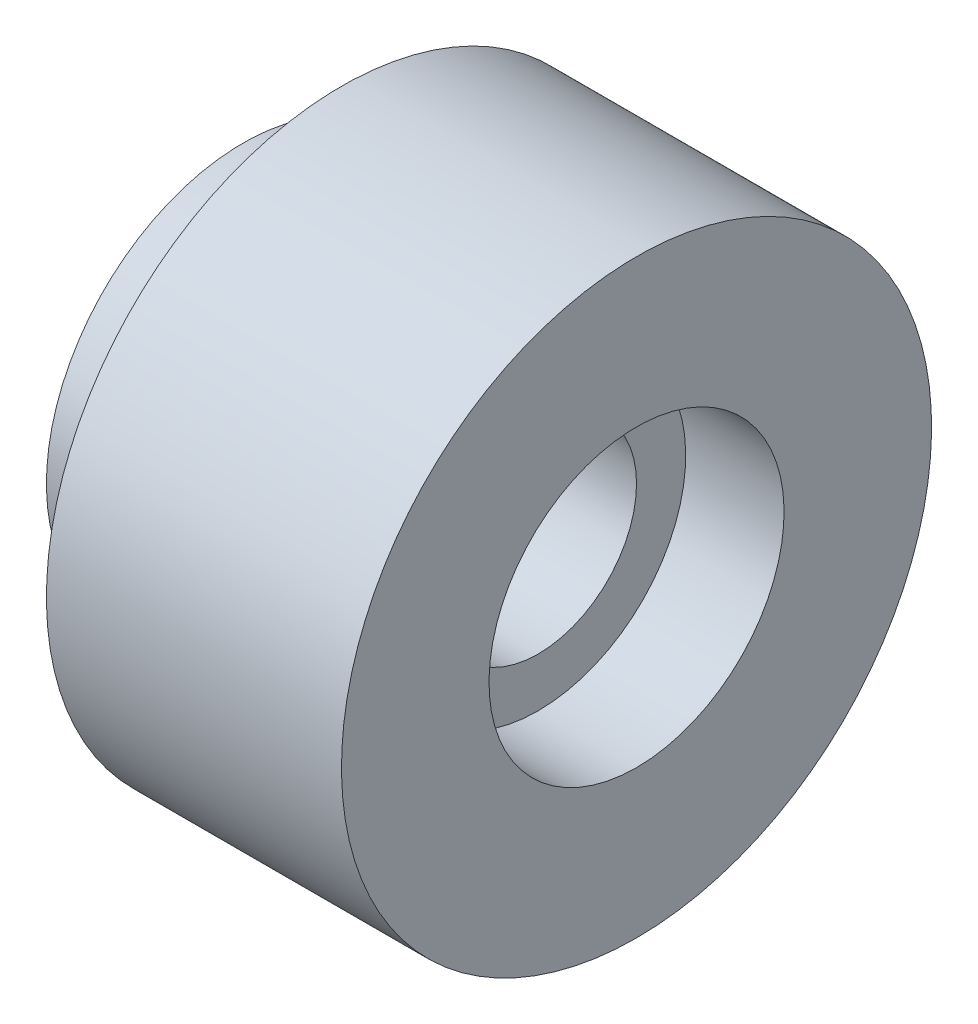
from build123d import *


with BuildPart() as part:
    # Szkic1 → Obr_t1 (revolve)
    with BuildSketch(Plane.XY, mode=Mode.PRIVATE) as obr_t1_sk:
        Polygon((0, 5), (0, 10), (5, 10), (5, 15), (20, 15), (20, 7.5), (15, 7.5), (15, 5), align=None)
    revolve(obr_t1_sk.sketch.rotate(Axis((0, 0, 0), (1, 0, 0)), 180), axis=Axis((0, 0, 0), (1, 0, 0)))


solid = part.part
